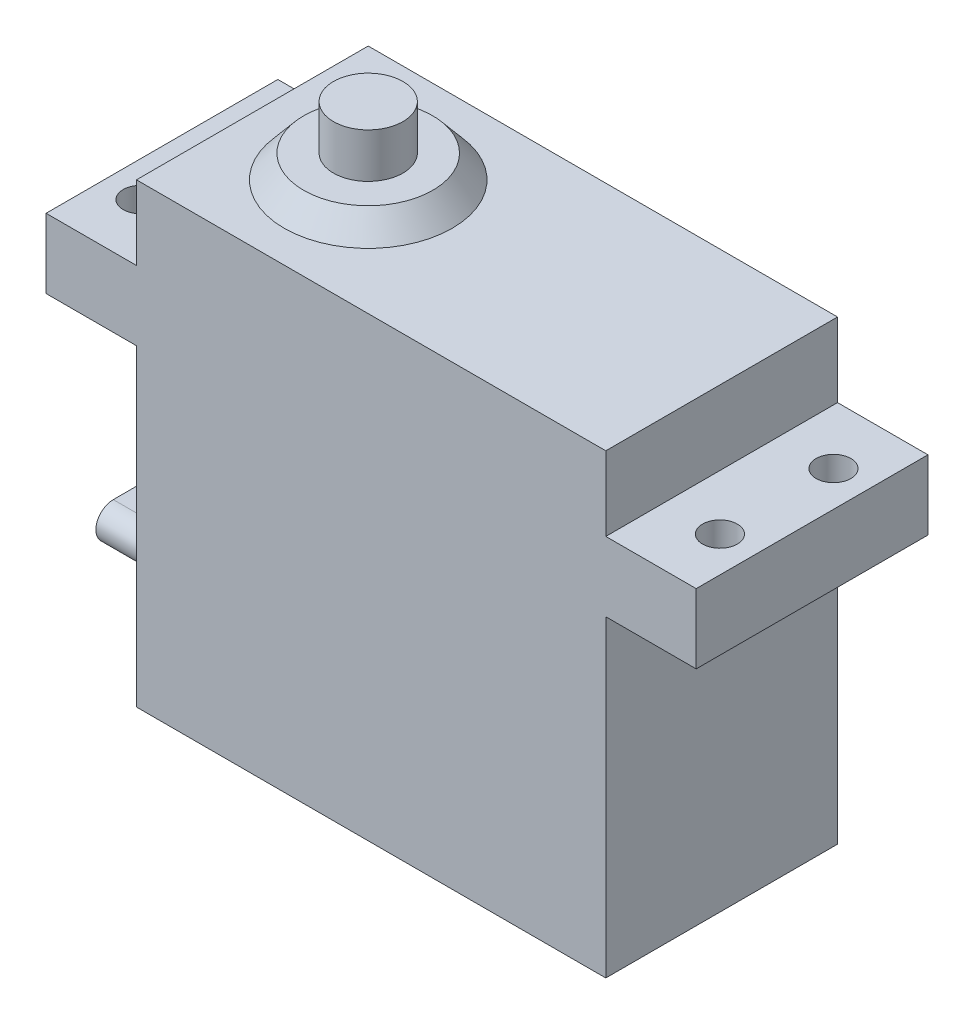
ISO-10303-21;
HEADER;
FILE_DESCRIPTION(('STEP AP214'),'2;1');
FILE_NAME('part.step','',(''),(''),'','','');
FILE_SCHEMA(('AUTOMOTIVE_DESIGN { 1 0 10303 214 1 1 1 1 }'));
ENDSEC;
DATA;
#1=APPLICATION_CONTEXT('core data for automotive mechanical design processes');
#2=APPLICATION_PROTOCOL_DEFINITION('international standard','automotive_design',2000,#1);
#3=PRODUCT_CONTEXT('',#1,'mechanical');
#4=PRODUCT('Part','Part','',(#3));
#5=PRODUCT_RELATED_PRODUCT_CATEGORY('part','',(#4));
#6=PRODUCT_DEFINITION_FORMATION('','',#4);
#7=PRODUCT_DEFINITION_CONTEXT('part definition',#1,'design');
#8=PRODUCT_DEFINITION('design','',#6,#7);
#9=PRODUCT_DEFINITION_SHAPE('','',#8);
#10=(LENGTH_UNIT() NAMED_UNIT(*) SI_UNIT(.MILLI.,.METRE.));
#11=(NAMED_UNIT(*) PLANE_ANGLE_UNIT() SI_UNIT($,.RADIAN.));
#12=(NAMED_UNIT(*) SI_UNIT($,.STERADIAN.) SOLID_ANGLE_UNIT());
#13=UNCERTAINTY_MEASURE_WITH_UNIT(LENGTH_MEASURE(1.E-05),#10,'distance_accuracy_value','');
#14=(GEOMETRIC_REPRESENTATION_CONTEXT(3) GLOBAL_UNCERTAINTY_ASSIGNED_CONTEXT((#13)) GLOBAL_UNIT_ASSIGNED_CONTEXT((#10,
#11,#12)) REPRESENTATION_CONTEXT('',''));
#15=CARTESIAN_POINT('',(0.,0.,0.));
#16=DIRECTION('',(0.,0.,1.));
#17=DIRECTION('',(1.,0.,0.));
#18=AXIS2_PLACEMENT_3D('',#15,#16,#17);
#19=CARTESIAN_POINT('',(10.,45.25,10.));
#20=DIRECTION('',(0.,-1.,0.));
#21=DIRECTION('',(0.,0.,-1.));
#22=AXIS2_PLACEMENT_3D('',#19,#20,#21);
#23=CYLINDRICAL_SURFACE('',#22,3.);
#24=CARTESIAN_POINT('',(10.,45.25,10.));
#25=DIRECTION('',(0.,1.,0.));
#26=DIRECTION('',(0.,0.,1.));
#27=AXIS2_PLACEMENT_3D('',#24,#25,#26);
#28=CIRCLE('',#27,3.);
#29=CARTESIAN_POINT('',(10.,45.25,7.));
#30=VERTEX_POINT('',#29);
#31=EDGE_CURVE('E11',#30,#30,#28,.T.);
#32=CARTESIAN_POINT('',(10.,41.4,10.));
#33=DIRECTION('',(0.,1.,0.));
#34=DIRECTION('',(0.,0.,1.));
#35=AXIS2_PLACEMENT_3D('',#32,#33,#34);
#36=CIRCLE('',#35,3.);
#37=CARTESIAN_POINT('',(10.,41.4,7.));
#38=VERTEX_POINT('',#37);
#39=EDGE_CURVE('E49',#38,#38,#36,.T.);
#40=CARTESIAN_POINT('',(10.,45.25,7.));
#41=CARTESIAN_POINT('',(10.,45.2098958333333,7.));
#42=CARTESIAN_POINT('',(10.,45.1697916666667,7.));
#43=CARTESIAN_POINT('',(10.,45.0895833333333,7.));
#44=CARTESIAN_POINT('',(10.,45.0494791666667,7.));
#45=CARTESIAN_POINT('',(10.,44.9692708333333,7.));
#46=CARTESIAN_POINT('',(10.,44.9291666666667,7.));
#47=CARTESIAN_POINT('',(10.,44.8489583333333,7.));
#48=CARTESIAN_POINT('',(10.,44.8088541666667,7.));
#49=CARTESIAN_POINT('',(10.,44.7286458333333,7.));
#50=CARTESIAN_POINT('',(10.,44.6885416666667,7.));
#51=CARTESIAN_POINT('',(10.,44.6083333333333,7.));
#52=CARTESIAN_POINT('',(10.,44.5682291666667,7.));
#53=CARTESIAN_POINT('',(10.,44.4880208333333,7.));
#54=CARTESIAN_POINT('',(10.,44.4479166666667,7.));
#55=CARTESIAN_POINT('',(10.,44.3677083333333,7.));
#56=CARTESIAN_POINT('',(10.,44.3276041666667,7.));
#57=CARTESIAN_POINT('',(10.,44.2473958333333,7.));
#58=CARTESIAN_POINT('',(10.,44.2072916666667,7.));
#59=CARTESIAN_POINT('',(10.,44.1270833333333,7.));
#60=CARTESIAN_POINT('',(10.,44.0869791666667,7.));
#61=CARTESIAN_POINT('',(10.,44.0067708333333,7.));
#62=CARTESIAN_POINT('',(10.,43.9666666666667,7.));
#63=CARTESIAN_POINT('',(10.,43.8864583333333,7.));
#64=CARTESIAN_POINT('',(10.,43.8463541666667,7.));
#65=CARTESIAN_POINT('',(10.,43.7661458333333,7.));
#66=CARTESIAN_POINT('',(10.,43.7260416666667,7.));
#67=CARTESIAN_POINT('',(10.,43.6458333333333,7.));
#68=CARTESIAN_POINT('',(10.,43.6057291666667,7.));
#69=CARTESIAN_POINT('',(10.,43.5255208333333,7.));
#70=CARTESIAN_POINT('',(10.,43.4854166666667,7.));
#71=CARTESIAN_POINT('',(10.,43.4052083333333,7.));
#72=CARTESIAN_POINT('',(10.,43.3651041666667,7.));
#73=CARTESIAN_POINT('',(10.,43.2848958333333,7.));
#74=CARTESIAN_POINT('',(10.,43.2447916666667,7.));
#75=CARTESIAN_POINT('',(10.,43.1645833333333,7.));
#76=CARTESIAN_POINT('',(10.,43.1244791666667,7.));
#77=CARTESIAN_POINT('',(10.,43.0442708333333,7.));
#78=CARTESIAN_POINT('',(10.,43.0041666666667,7.));
#79=CARTESIAN_POINT('',(10.,42.9239583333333,7.));
#80=CARTESIAN_POINT('',(10.,42.8838541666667,7.));
#81=CARTESIAN_POINT('',(10.,42.8036458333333,7.));
#82=CARTESIAN_POINT('',(10.,42.7635416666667,7.));
#83=CARTESIAN_POINT('',(10.,42.6833333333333,7.));
#84=CARTESIAN_POINT('',(10.,42.6432291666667,7.));
#85=CARTESIAN_POINT('',(10.,42.5630208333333,7.));
#86=CARTESIAN_POINT('',(10.,42.5229166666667,7.));
#87=CARTESIAN_POINT('',(10.,42.4427083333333,7.));
#88=CARTESIAN_POINT('',(10.,42.4026041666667,7.));
#89=CARTESIAN_POINT('',(10.,42.3223958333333,7.));
#90=CARTESIAN_POINT('',(10.,42.2822916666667,7.));
#91=CARTESIAN_POINT('',(10.,42.2020833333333,7.));
#92=CARTESIAN_POINT('',(10.,42.1619791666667,7.));
#93=CARTESIAN_POINT('',(10.,42.0817708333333,7.));
#94=CARTESIAN_POINT('',(10.,42.0416666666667,7.));
#95=CARTESIAN_POINT('',(10.,41.9614583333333,7.));
#96=CARTESIAN_POINT('',(10.,41.9213541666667,7.));
#97=CARTESIAN_POINT('',(10.,41.8411458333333,7.));
#98=CARTESIAN_POINT('',(10.,41.8010416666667,7.));
#99=CARTESIAN_POINT('',(10.,41.7208333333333,7.));
#100=CARTESIAN_POINT('',(10.,41.6807291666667,7.));
#101=CARTESIAN_POINT('',(10.,41.6005208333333,7.));
#102=CARTESIAN_POINT('',(10.,41.5604166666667,7.));
#103=CARTESIAN_POINT('',(10.,41.4802083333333,7.));
#104=CARTESIAN_POINT('',(10.,41.4401041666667,7.));
#105=CARTESIAN_POINT('',(10.,41.4,7.));
#106=B_SPLINE_CURVE_WITH_KNOTS('',3,(#40,#41,#42,#43,#44,#45,#46,#47,#48,#49,#50,#51,#52,#53,
#54,#55,#56,#57,#58,#59,#60,#61,#62,#63,#64,#65,#66,#67,#68,#69,#70,#71,#72,#73,#74,#75,#76,#77,
#78,#79,#80,#81,#82,#83,#84,#85,#86,#87,#88,#89,#90,#91,#92,#93,#94,#95,#96,#97,#98,#99,#100,
#101,#102,#103,#104,#105),.UNSPECIFIED.,.F.,.F.,(4,2,2,2,2,2,2,2,2,2,2,2,2,2,2,2,2,2,2,2,2,2,2,
2,2,2,2,2,2,2,2,2,4),(0.,0.120312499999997,0.240624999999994,0.360937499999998,
0.481249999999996,0.6015625,0.721874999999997,0.842187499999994,0.962499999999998,1.0828125,
1.203125,1.3234375,1.44374999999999,1.5640625,1.68437499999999,1.8046875,1.925,2.04531249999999,
2.165625,2.28593749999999,2.40625,2.5265625,2.64687499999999,2.7671875,2.88749999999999,
3.0078125,3.128125,3.24843749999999,3.36875,3.48906249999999,3.609375,3.7296875,
3.84999999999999),.UNSPECIFIED.);
#107=EDGE_CURVE('BSEAM46',#30,#38,#106,.T.);
#108=ORIENTED_EDGE('',*,*,#31,.F.);
#109=ORIENTED_EDGE('',*,*,#39,.T.);
#110=ORIENTED_EDGE('',*,*,#107,.T.);
#111=ORIENTED_EDGE('',*,*,#107,.F.);
#112=EDGE_LOOP('',(#108,#110,#109,#111));
#113=FACE_BOUND('',#112,.T.);
#114=ADVANCED_FACE('F46',(#113),#23,.T.);
#115=CARTESIAN_POINT('',(10.,45.25,10.));
#116=DIRECTION('',(0.,1.,0.));
#117=DIRECTION('',(0.,0.,1.));
#118=AXIS2_PLACEMENT_3D('',#115,#116,#117);
#119=PLANE('',#118);
#120=ORIENTED_EDGE('',*,*,#31,.T.);
#121=EDGE_LOOP('',(#120));
#122=FACE_BOUND('',#121,.T.);
#123=ADVANCED_FACE('F61',(#122),#119,.T.);
#124=CARTESIAN_POINT('',(10.,41.4,10.));
#125=DIRECTION('',(0.,1.,0.));
#126=DIRECTION('',(0.,0.,1.));
#127=AXIS2_PLACEMENT_3D('',#124,#125,#126);
#128=PLANE('',#127);
#129=ORIENTED_EDGE('',*,*,#39,.F.);
#130=EDGE_LOOP('',(#129));
#131=FACE_BOUND('',#130,.T.);
#132=ADVANCED_FACE('F59',(#131),#128,.F.);
#133=CLOSED_SHELL('',(#114,#123,#132));
#134=MANIFOLD_SOLID_BREP('B2',#133);
#135=CARTESIAN_POINT('',(0.,39.4,20.));
#136=DIRECTION('',(0.,-1.,0.));
#137=DIRECTION('',(0.,0.,-1.));
#138=AXIS2_PLACEMENT_3D('',#135,#136,#137);
#139=PLANE('',#138);
#140=DIRECTION('',(-1.,0.,0.));
#141=VECTOR('',#140,1.);
#142=CARTESIAN_POINT('',(0.,39.4,0.));
#143=LINE('',#142,#141);
#144=CARTESIAN_POINT('',(40.5,39.4,0.));
#145=VERTEX_POINT('',#144);
#146=CARTESIAN_POINT('',(0.,39.4,0.));
#147=VERTEX_POINT('',#146);
#148=EDGE_CURVE('E344',#145,#147,#143,.T.);
#149=ORIENTED_EDGE('',*,*,#148,.T.);
#150=DIRECTION('',(0.,0.,-1.));
#151=VECTOR('',#150,1.);
#152=CARTESIAN_POINT('',(0.,39.4,20.));
#153=LINE('',#152,#151);
#154=CARTESIAN_POINT('',(0.,39.4,20.));
#155=VERTEX_POINT('',#154);
#156=EDGE_CURVE('E364',#155,#147,#153,.T.);
#157=ORIENTED_EDGE('',*,*,#156,.F.);
#158=DIRECTION('',(-1.,0.,0.));
#159=VECTOR('',#158,1.);
#160=CARTESIAN_POINT('',(0.,39.4,20.));
#161=LINE('',#160,#159);
#162=CARTESIAN_POINT('',(40.5,39.4,20.));
#163=VERTEX_POINT('',#162);
#164=EDGE_CURVE('E318',#163,#155,#161,.T.);
#165=ORIENTED_EDGE('',*,*,#164,.F.);
#166=DIRECTION('',(0.,0.,-1.));
#167=VECTOR('',#166,1.);
#168=CARTESIAN_POINT('',(40.5,39.4,20.));
#169=LINE('',#168,#167);
#170=EDGE_CURVE('E367',#163,#145,#169,.T.);
#171=ORIENTED_EDGE('',*,*,#170,.T.);
#172=EDGE_LOOP('',(#149,#157,#165,#171));
#173=FACE_BOUND('',#172,.T.);
#174=CARTESIAN_POINT('',(10.,39.4,10.));
#175=DIRECTION('',(0.,-1.,0.));
#176=DIRECTION('',(0.,0.,-1.));
#177=AXIS2_PLACEMENT_3D('',#174,#175,#176);
#178=CIRCLE('',#177,7.25);
#179=CARTESIAN_POINT('',(10.,39.4,2.75));
#180=VERTEX_POINT('',#179);
#181=EDGE_CURVE('E44',#180,#180,#178,.F.);
#182=ORIENTED_EDGE('',*,*,#181,.F.);
#183=EDGE_LOOP('',(#182));
#184=FACE_BOUND('',#183,.T.);
#185=ADVANCED_FACE('F86',(#173,#184),#139,.F.);
#186=CARTESIAN_POINT('',(-0.5,4.5,8.50000000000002));
#187=DIRECTION('',(-1.,0.,0.));
#188=DIRECTION('',(0.,0.,1.));
#189=AXIS2_PLACEMENT_3D('',#186,#187,#188);
#190=PLANE('',#189);
#191=CARTESIAN_POINT('',(-0.5,4.5,8.50000000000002));
#192=DIRECTION('',(-1.,0.,0.));
#193=DIRECTION('',(0.,0.,1.));
#194=AXIS2_PLACEMENT_3D('',#191,#192,#193);
#195=CIRCLE('',#194,2.);
#196=CARTESIAN_POINT('',(-0.5,6.5,8.50000000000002));
#197=VERTEX_POINT('',#196);
#198=CARTESIAN_POINT('',(-0.5,2.5,8.50000000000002));
#199=VERTEX_POINT('',#198);
#200=EDGE_CURVE('E255',#197,#199,#195,.T.);
#201=ORIENTED_EDGE('',*,*,#200,.T.);
#202=DIRECTION('',(0.,0.,1.));
#203=VECTOR('',#202,1.);
#204=CARTESIAN_POINT('',(-0.5,2.5,11.5));
#205=LINE('',#204,#203);
#206=CARTESIAN_POINT('',(-0.5,2.5,11.5));
#207=VERTEX_POINT('',#206);
#208=EDGE_CURVE('E258',#199,#207,#205,.T.);
#209=ORIENTED_EDGE('',*,*,#208,.T.);
#210=CARTESIAN_POINT('',(-0.5,4.5,11.5));
#211=DIRECTION('',(-1.,0.,0.));
#212=DIRECTION('',(0.,0.,-1.));
#213=AXIS2_PLACEMENT_3D('',#210,#211,#212);
#214=CIRCLE('',#213,2.);
#215=CARTESIAN_POINT('',(-0.5,6.5,11.5));
#216=VERTEX_POINT('',#215);
#217=EDGE_CURVE('E261',#207,#216,#214,.T.);
#218=ORIENTED_EDGE('',*,*,#217,.T.);
#219=DIRECTION('',(0.,0.,-1.));
#220=VECTOR('',#219,1.);
#221=CARTESIAN_POINT('',(-0.5,6.5,8.50000000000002));
#222=LINE('',#221,#220);
#223=EDGE_CURVE('E263',#216,#197,#222,.T.);
#224=ORIENTED_EDGE('',*,*,#223,.T.);
#225=EDGE_LOOP('',(#201,#209,#218,#224));
#226=FACE_BOUND('',#225,.T.);
#227=DIRECTION('',(0.,0.,1.));
#228=VECTOR('',#227,1.);
#229=CARTESIAN_POINT('',(-0.5,3.,8.50000000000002));
#230=LINE('',#229,#228);
#231=CARTESIAN_POINT('',(-0.5,3.,8.50000000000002));
#232=VERTEX_POINT('',#231);
#233=CARTESIAN_POINT('',(-0.5,3.,11.5));
#234=VERTEX_POINT('',#233);
#235=EDGE_CURVE('E674',#232,#234,#230,.T.);
#236=ORIENTED_EDGE('',*,*,#235,.F.);
#237=CARTESIAN_POINT('',(-0.5,4.5,8.50000000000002));
#238=DIRECTION('',(-1.,0.,0.));
#239=DIRECTION('',(0.,0.,1.));
#240=AXIS2_PLACEMENT_3D('',#237,#238,#239);
#241=CIRCLE('',#240,1.5);
#242=CARTESIAN_POINT('',(-0.5,6.,8.50000000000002));
#243=VERTEX_POINT('',#242);
#244=EDGE_CURVE('E246',#243,#232,#241,.T.);
#245=ORIENTED_EDGE('',*,*,#244,.F.);
#246=DIRECTION('',(0.,0.,-1.));
#247=VECTOR('',#246,1.);
#248=CARTESIAN_POINT('',(-0.5,6.,11.5));
#249=LINE('',#248,#247);
#250=CARTESIAN_POINT('',(-0.5,6.,11.5));
#251=VERTEX_POINT('',#250);
#252=EDGE_CURVE('E242',#251,#243,#249,.T.);
#253=ORIENTED_EDGE('',*,*,#252,.F.);
#254=CARTESIAN_POINT('',(-0.5,4.5,11.5));
#255=DIRECTION('',(-1.,0.,0.));
#256=DIRECTION('',(0.,0.,1.));
#257=AXIS2_PLACEMENT_3D('',#254,#255,#256);
#258=CIRCLE('',#257,1.5);
#259=EDGE_CURVE('E681',#234,#251,#258,.T.);
#260=ORIENTED_EDGE('',*,*,#259,.F.);
#261=EDGE_LOOP('',(#236,#245,#253,#260));
#262=FACE_BOUND('',#261,.T.);
#263=ADVANCED_FACE('F411',(#226,#262),#190,.T.);
#264=CARTESIAN_POINT('',(0.,0.,20.));
#265=DIRECTION('',(1.,0.,0.));
#266=DIRECTION('',(0.,0.,-1.));
#267=AXIS2_PLACEMENT_3D('',#264,#265,#266);
#268=PLANE('',#267);
#269=DIRECTION('',(0.,-1.,0.));
#270=VECTOR('',#269,1.);
#271=CARTESIAN_POINT('',(0.,0.,0.));
#272=LINE('',#271,#270);
#273=CARTESIAN_POINT('',(0.,27.,0.));
#274=VERTEX_POINT('',#273);
#275=CARTESIAN_POINT('',(0.,0.,0.));
#276=VERTEX_POINT('',#275);
#277=EDGE_CURVE('E329',#274,#276,#272,.T.);
#278=ORIENTED_EDGE('',*,*,#277,.T.);
#279=DIRECTION('',(0.,0.,-1.));
#280=VECTOR('',#279,1.);
#281=CARTESIAN_POINT('',(0.,0.,20.));
#282=LINE('',#281,#280);
#283=CARTESIAN_POINT('',(0.,0.,20.));
#284=VERTEX_POINT('',#283);
#285=EDGE_CURVE('E94',#284,#276,#282,.T.);
#286=ORIENTED_EDGE('',*,*,#285,.F.);
#287=DIRECTION('',(0.,-1.,0.));
#288=VECTOR('',#287,1.);
#289=CARTESIAN_POINT('',(0.,0.,20.));
#290=LINE('',#289,#288);
#291=CARTESIAN_POINT('',(0.,27.,20.));
#292=VERTEX_POINT('',#291);
#293=EDGE_CURVE('E302',#292,#284,#290,.T.);
#294=ORIENTED_EDGE('',*,*,#293,.F.);
#295=DIRECTION('',(0.,0.,-1.));
#296=VECTOR('',#295,1.);
#297=CARTESIAN_POINT('',(0.,27.,20.));
#298=LINE('',#297,#296);
#299=EDGE_CURVE('E328',#292,#274,#298,.T.);
#300=ORIENTED_EDGE('',*,*,#299,.T.);
#301=EDGE_LOOP('',(#278,#286,#294,#300));
#302=FACE_BOUND('',#301,.T.);
#303=CARTESIAN_POINT('',(0.,4.5,8.50000000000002));
#304=DIRECTION('',(-1.,0.,0.));
#305=DIRECTION('',(0.,0.,1.));
#306=AXIS2_PLACEMENT_3D('',#303,#304,#305);
#307=CIRCLE('',#306,2.);
#308=CARTESIAN_POINT('',(0.,6.5,8.50000000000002));
#309=VERTEX_POINT('',#308);
#310=CARTESIAN_POINT('',(0.,2.5,8.50000000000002));
#311=VERTEX_POINT('',#310);
#312=EDGE_CURVE('E248',#309,#311,#307,.T.);
#313=ORIENTED_EDGE('',*,*,#312,.F.);
#314=DIRECTION('',(0.,0.,-1.));
#315=VECTOR('',#314,1.);
#316=CARTESIAN_POINT('',(0.,6.5,8.50000000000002));
#317=LINE('',#316,#315);
#318=CARTESIAN_POINT('',(0.,6.5,11.5));
#319=VERTEX_POINT('',#318);
#320=EDGE_CURVE('E259',#319,#309,#317,.T.);
#321=ORIENTED_EDGE('',*,*,#320,.F.);
#322=CARTESIAN_POINT('',(0.,4.5,11.5));
#323=DIRECTION('',(-1.,0.,0.));
#324=DIRECTION('',(0.,0.,-1.));
#325=AXIS2_PLACEMENT_3D('',#322,#323,#324);
#326=CIRCLE('',#325,2.);
#327=CARTESIAN_POINT('',(0.,2.5,11.5));
#328=VERTEX_POINT('',#327);
#329=EDGE_CURVE('E267',#328,#319,#326,.T.);
#330=ORIENTED_EDGE('',*,*,#329,.F.);
#331=DIRECTION('',(0.,0.,1.));
#332=VECTOR('',#331,1.);
#333=CARTESIAN_POINT('',(0.,2.5,11.5));
#334=LINE('',#333,#332);
#335=EDGE_CURVE('E109',#311,#328,#334,.T.);
#336=ORIENTED_EDGE('',*,*,#335,.F.);
#337=EDGE_LOOP('',(#313,#321,#330,#336));
#338=FACE_BOUND('',#337,.T.);
#339=ADVANCED_FACE('F88',(#302,#338),#268,.F.);
#340=CARTESIAN_POINT('',(0.,0.,20.));
#341=DIRECTION('',(0.,1.,0.));
#342=DIRECTION('',(0.,0.,1.));
#343=AXIS2_PLACEMENT_3D('',#340,#341,#342);
#344=PLANE('',#343);
#345=DIRECTION('',(1.,0.,0.));
#346=VECTOR('',#345,1.);
#347=CARTESIAN_POINT('',(0.,0.,0.));
#348=LINE('',#347,#346);
#349=CARTESIAN_POINT('',(40.5,0.,0.));
#350=VERTEX_POINT('',#349);
#351=EDGE_CURVE('E332',#276,#350,#348,.T.);
#352=ORIENTED_EDGE('',*,*,#351,.T.);
#353=DIRECTION('',(0.,0.,-1.));
#354=VECTOR('',#353,1.);
#355=CARTESIAN_POINT('',(40.5,0.,20.));
#356=LINE('',#355,#354);
#357=CARTESIAN_POINT('',(40.5,0.,20.));
#358=VERTEX_POINT('',#357);
#359=EDGE_CURVE('E382',#358,#350,#356,.T.);
#360=ORIENTED_EDGE('',*,*,#359,.F.);
#361=DIRECTION('',(1.,0.,0.));
#362=VECTOR('',#361,1.);
#363=CARTESIAN_POINT('',(0.,0.,20.));
#364=LINE('',#363,#362);
#365=EDGE_CURVE('E305',#284,#358,#364,.T.);
#366=ORIENTED_EDGE('',*,*,#365,.F.);
#367=ORIENTED_EDGE('',*,*,#285,.T.);
#368=EDGE_LOOP('',(#352,#360,#366,#367));
#369=FACE_BOUND('',#368,.T.);
#370=ADVANCED_FACE('F442',(#369),#344,.F.);
#371=CARTESIAN_POINT('',(40.5,0.,20.));
#372=DIRECTION('',(-1.,0.,0.));
#373=DIRECTION('',(0.,0.,1.));
#374=AXIS2_PLACEMENT_3D('',#371,#372,#373);
#375=PLANE('',#374);
#376=DIRECTION('',(0.,1.,0.));
#377=VECTOR('',#376,1.);
#378=CARTESIAN_POINT('',(40.5,0.,0.));
#379=LINE('',#378,#377);
#380=CARTESIAN_POINT('',(40.5,27.,0.));
#381=VERTEX_POINT('',#380);
#382=EDGE_CURVE('E334',#350,#381,#379,.T.);
#383=ORIENTED_EDGE('',*,*,#382,.T.);
#384=DIRECTION('',(0.,0.,-1.));
#385=VECTOR('',#384,1.);
#386=CARTESIAN_POINT('',(40.5,27.,20.));
#387=LINE('',#386,#385);
#388=CARTESIAN_POINT('',(40.5,27.,20.));
#389=VERTEX_POINT('',#388);
#390=EDGE_CURVE('E379',#389,#381,#387,.T.);
#391=ORIENTED_EDGE('',*,*,#390,.F.);
#392=DIRECTION('',(0.,1.,0.));
#393=VECTOR('',#392,1.);
#394=CARTESIAN_POINT('',(40.5,0.,20.));
#395=LINE('',#394,#393);
#396=EDGE_CURVE('E308',#358,#389,#395,.T.);
#397=ORIENTED_EDGE('',*,*,#396,.F.);
#398=ORIENTED_EDGE('',*,*,#359,.T.);
#399=EDGE_LOOP('',(#383,#391,#397,#398));
#400=FACE_BOUND('',#399,.T.);
#401=ADVANCED_FACE('F439',(#400),#375,.F.);
#402=CARTESIAN_POINT('',(40.5,27.,20.));
#403=DIRECTION('',(0.,1.,0.));
#404=DIRECTION('',(-1.,0.,0.));
#405=AXIS2_PLACEMENT_3D('',#402,#403,#404);
#406=PLANE('',#405);
#407=CARTESIAN_POINT('',(45.25,27.,5.1));
#408=DIRECTION('',(0.,1.,0.));
#409=DIRECTION('',(-1.,0.,0.));
#410=AXIS2_PLACEMENT_3D('',#407,#408,#409);
#411=CIRCLE('',#410,1.5);
#412=CARTESIAN_POINT('',(43.75,27.,5.1));
#413=VERTEX_POINT('',#412);
#414=EDGE_CURVE('E285',#413,#413,#411,.T.);
#415=ORIENTED_EDGE('',*,*,#414,.T.);
#416=EDGE_LOOP('',(#415));
#417=FACE_BOUND('',#416,.T.);
#418=CARTESIAN_POINT('',(45.25,27.,14.9));
#419=DIRECTION('',(0.,1.,0.));
#420=DIRECTION('',(-1.,0.,0.));
#421=AXIS2_PLACEMENT_3D('',#418,#419,#420);
#422=CIRCLE('',#421,1.5);
#423=CARTESIAN_POINT('',(43.75,27.,14.9));
#424=VERTEX_POINT('',#423);
#425=EDGE_CURVE('E291',#424,#424,#422,.T.);
#426=ORIENTED_EDGE('',*,*,#425,.T.);
#427=EDGE_LOOP('',(#426));
#428=FACE_BOUND('',#427,.T.);
#429=DIRECTION('',(1.,0.,0.));
#430=VECTOR('',#429,1.);
#431=CARTESIAN_POINT('',(40.5,27.,0.));
#432=LINE('',#431,#430);
#433=CARTESIAN_POINT('',(48.3,27.,0.));
#434=VERTEX_POINT('',#433);
#435=EDGE_CURVE('E336',#381,#434,#432,.T.);
#436=ORIENTED_EDGE('',*,*,#435,.T.);
#437=DIRECTION('',(0.,0.,-1.));
#438=VECTOR('',#437,1.);
#439=CARTESIAN_POINT('',(48.3,27.,20.));
#440=LINE('',#439,#438);
#441=CARTESIAN_POINT('',(48.3,27.,20.));
#442=VERTEX_POINT('',#441);
#443=EDGE_CURVE('E376',#442,#434,#440,.T.);
#444=ORIENTED_EDGE('',*,*,#443,.F.);
#445=DIRECTION('',(1.,0.,0.));
#446=VECTOR('',#445,1.);
#447=CARTESIAN_POINT('',(40.5,27.,20.));
#448=LINE('',#447,#446);
#449=EDGE_CURVE('E310',#389,#442,#448,.T.);
#450=ORIENTED_EDGE('',*,*,#449,.F.);
#451=ORIENTED_EDGE('',*,*,#390,.T.);
#452=EDGE_LOOP('',(#436,#444,#450,#451));
#453=FACE_BOUND('',#452,.T.);
#454=ADVANCED_FACE('F435',(#417,#428,#453),#406,.F.);
#455=CARTESIAN_POINT('',(48.3,27.,20.));
#456=DIRECTION('',(-1.,0.,0.));
#457=DIRECTION('',(0.,0.,1.));
#458=AXIS2_PLACEMENT_3D('',#455,#456,#457);
#459=PLANE('',#458);
#460=DIRECTION('',(0.,1.,0.));
#461=VECTOR('',#460,1.);
#462=CARTESIAN_POINT('',(48.3,27.,0.));
#463=LINE('',#462,#461);
#464=CARTESIAN_POINT('',(48.3,33.,0.));
#465=VERTEX_POINT('',#464);
#466=EDGE_CURVE('E338',#434,#465,#463,.T.);
#467=ORIENTED_EDGE('',*,*,#466,.T.);
#468=DIRECTION('',(0.,0.,-1.));
#469=VECTOR('',#468,1.);
#470=CARTESIAN_POINT('',(48.3,33.,20.));
#471=LINE('',#470,#469);
#472=CARTESIAN_POINT('',(48.3,33.,20.));
#473=VERTEX_POINT('',#472);
#474=EDGE_CURVE('E373',#473,#465,#471,.T.);
#475=ORIENTED_EDGE('',*,*,#474,.F.);
#476=DIRECTION('',(0.,1.,0.));
#477=VECTOR('',#476,1.);
#478=CARTESIAN_POINT('',(48.3,27.,20.));
#479=LINE('',#478,#477);
#480=EDGE_CURVE('E312',#442,#473,#479,.T.);
#481=ORIENTED_EDGE('',*,*,#480,.F.);
#482=ORIENTED_EDGE('',*,*,#443,.T.);
#483=EDGE_LOOP('',(#467,#475,#481,#482));
#484=FACE_BOUND('',#483,.T.);
#485=ADVANCED_FACE('F431',(#484),#459,.F.);
#486=CARTESIAN_POINT('',(48.3,33.,20.));
#487=DIRECTION('',(0.,-1.,0.));
#488=DIRECTION('',(0.,0.,-1.));
#489=AXIS2_PLACEMENT_3D('',#486,#487,#488);
#490=PLANE('',#489);
#491=CARTESIAN_POINT('',(45.25,33.,5.1));
#492=DIRECTION('',(0.,1.,0.));
#493=DIRECTION('',(0.,0.,1.));
#494=AXIS2_PLACEMENT_3D('',#491,#492,#493);
#495=CIRCLE('',#494,1.5);
#496=CARTESIAN_POINT('',(45.25,33.,6.6));
#497=VERTEX_POINT('',#496);
#498=EDGE_CURVE('E282',#497,#497,#495,.T.);
#499=ORIENTED_EDGE('',*,*,#498,.F.);
#500=EDGE_LOOP('',(#499));
#501=FACE_BOUND('',#500,.T.);
#502=CARTESIAN_POINT('',(45.25,33.,14.9));
#503=DIRECTION('',(0.,1.,0.));
#504=DIRECTION('',(0.,0.,1.));
#505=AXIS2_PLACEMENT_3D('',#502,#503,#504);
#506=CIRCLE('',#505,1.5);
#507=CARTESIAN_POINT('',(45.25,33.,16.4));
#508=VERTEX_POINT('',#507);
#509=EDGE_CURVE('E288',#508,#508,#506,.T.);
#510=ORIENTED_EDGE('',*,*,#509,.F.);
#511=EDGE_LOOP('',(#510));
#512=FACE_BOUND('',#511,.T.);
#513=DIRECTION('',(-1.,0.,0.));
#514=VECTOR('',#513,1.);
#515=CARTESIAN_POINT('',(48.3,33.,0.));
#516=LINE('',#515,#514);
#517=CARTESIAN_POINT('',(40.5,33.,0.));
#518=VERTEX_POINT('',#517);
#519=EDGE_CURVE('E340',#465,#518,#516,.T.);
#520=ORIENTED_EDGE('',*,*,#519,.T.);
#521=DIRECTION('',(0.,0.,-1.));
#522=VECTOR('',#521,1.);
#523=CARTESIAN_POINT('',(40.5,33.,20.));
#524=LINE('',#523,#522);
#525=CARTESIAN_POINT('',(40.5,33.,20.));
#526=VERTEX_POINT('',#525);
#527=EDGE_CURVE('E370',#526,#518,#524,.T.);
#528=ORIENTED_EDGE('',*,*,#527,.F.);
#529=DIRECTION('',(-1.,0.,0.));
#530=VECTOR('',#529,1.);
#531=CARTESIAN_POINT('',(48.3,33.,20.));
#532=LINE('',#531,#530);
#533=EDGE_CURVE('E314',#473,#526,#532,.T.);
#534=ORIENTED_EDGE('',*,*,#533,.F.);
#535=ORIENTED_EDGE('',*,*,#474,.T.);
#536=EDGE_LOOP('',(#520,#528,#534,#535));
#537=FACE_BOUND('',#536,.T.);
#538=ADVANCED_FACE('F427',(#501,#512,#537),#490,.F.);
#539=CARTESIAN_POINT('',(40.5,33.,20.));
#540=DIRECTION('',(-1.,0.,0.));
#541=DIRECTION('',(0.,0.,1.));
#542=AXIS2_PLACEMENT_3D('',#539,#540,#541);
#543=PLANE('',#542);
#544=DIRECTION('',(0.,1.,0.));
#545=VECTOR('',#544,1.);
#546=CARTESIAN_POINT('',(40.5,33.,0.));
#547=LINE('',#546,#545);
#548=EDGE_CURVE('E342',#518,#145,#547,.T.);
#549=ORIENTED_EDGE('',*,*,#548,.T.);
#550=ORIENTED_EDGE('',*,*,#170,.F.);
#551=DIRECTION('',(0.,1.,0.));
#552=VECTOR('',#551,1.);
#553=CARTESIAN_POINT('',(40.5,33.,20.));
#554=LINE('',#553,#552);
#555=EDGE_CURVE('E316',#526,#163,#554,.T.);
#556=ORIENTED_EDGE('',*,*,#555,.F.);
#557=ORIENTED_EDGE('',*,*,#527,.T.);
#558=EDGE_LOOP('',(#549,#550,#556,#557));
#559=FACE_BOUND('',#558,.T.);
#560=ADVANCED_FACE('F424',(#559),#543,.F.);
#561=CARTESIAN_POINT('',(0.,33.,20.));
#562=DIRECTION('',(1.,0.,0.));
#563=DIRECTION('',(0.,1.,0.));
#564=AXIS2_PLACEMENT_3D('',#561,#562,#563);
#565=PLANE('',#564);
#566=DIRECTION('',(0.,-1.,0.));
#567=VECTOR('',#566,1.);
#568=CARTESIAN_POINT('',(0.,33.,0.));
#569=LINE('',#568,#567);
#570=CARTESIAN_POINT('',(0.,33.,0.));
#571=VERTEX_POINT('',#570);
#572=EDGE_CURVE('E346',#147,#571,#569,.T.);
#573=ORIENTED_EDGE('',*,*,#572,.T.);
#574=DIRECTION('',(0.,0.,-1.));
#575=VECTOR('',#574,1.);
#576=CARTESIAN_POINT('',(0.,33.,20.));
#577=LINE('',#576,#575);
#578=CARTESIAN_POINT('',(0.,33.,20.));
#579=VERTEX_POINT('',#578);
#580=EDGE_CURVE('E361',#579,#571,#577,.T.);
#581=ORIENTED_EDGE('',*,*,#580,.F.);
#582=DIRECTION('',(0.,-1.,0.));
#583=VECTOR('',#582,1.);
#584=CARTESIAN_POINT('',(0.,33.,20.));
#585=LINE('',#584,#583);
#586=EDGE_CURVE('E320',#155,#579,#585,.T.);
#587=ORIENTED_EDGE('',*,*,#586,.F.);
#588=ORIENTED_EDGE('',*,*,#156,.T.);
#589=EDGE_LOOP('',(#573,#581,#587,#588));
#590=FACE_BOUND('',#589,.T.);
#591=ADVANCED_FACE('F422',(#590),#565,.F.);
#592=CARTESIAN_POINT('',(0.,33.,20.));
#593=DIRECTION('',(0.,-1.,0.));
#594=DIRECTION('',(0.,0.,-1.));
#595=AXIS2_PLACEMENT_3D('',#592,#593,#594);
#596=PLANE('',#595);
#597=CARTESIAN_POINT('',(-4.75,33.,14.9));
#598=DIRECTION('',(0.,1.,0.));
#599=DIRECTION('',(0.,0.,1.));
#600=AXIS2_PLACEMENT_3D('',#597,#598,#599);
#601=CIRCLE('',#600,1.5);
#602=CARTESIAN_POINT('',(-4.75,33.,16.4));
#603=VERTEX_POINT('',#602);
#604=EDGE_CURVE('E294',#603,#603,#601,.T.);
#605=ORIENTED_EDGE('',*,*,#604,.F.);
#606=EDGE_LOOP('',(#605));
#607=FACE_BOUND('',#606,.T.);
#608=CARTESIAN_POINT('',(-4.75,33.,5.1));
#609=DIRECTION('',(0.,1.,0.));
#610=DIRECTION('',(0.,0.,1.));
#611=AXIS2_PLACEMENT_3D('',#608,#609,#610);
#612=CIRCLE('',#611,1.5);
#613=CARTESIAN_POINT('',(-4.75,33.,6.6));
#614=VERTEX_POINT('',#613);
#615=EDGE_CURVE('E298',#614,#614,#612,.T.);
#616=ORIENTED_EDGE('',*,*,#615,.F.);
#617=EDGE_LOOP('',(#616));
#618=FACE_BOUND('',#617,.T.);
#619=DIRECTION('',(-1.,0.,0.));
#620=VECTOR('',#619,1.);
#621=CARTESIAN_POINT('',(0.,33.,0.));
#622=LINE('',#621,#620);
#623=CARTESIAN_POINT('',(-7.8,33.,0.));
#624=VERTEX_POINT('',#623);
#625=EDGE_CURVE('E348',#571,#624,#622,.T.);
#626=ORIENTED_EDGE('',*,*,#625,.T.);
#627=DIRECTION('',(0.,0.,-1.));
#628=VECTOR('',#627,1.);
#629=CARTESIAN_POINT('',(-7.8,33.,20.));
#630=LINE('',#629,#628);
#631=CARTESIAN_POINT('',(-7.8,33.,20.));
#632=VERTEX_POINT('',#631);
#633=EDGE_CURVE('E358',#632,#624,#630,.T.);
#634=ORIENTED_EDGE('',*,*,#633,.F.);
#635=DIRECTION('',(-1.,0.,0.));
#636=VECTOR('',#635,1.);
#637=CARTESIAN_POINT('',(0.,33.,20.));
#638=LINE('',#637,#636);
#639=EDGE_CURVE('E322',#579,#632,#638,.T.);
#640=ORIENTED_EDGE('',*,*,#639,.F.);
#641=ORIENTED_EDGE('',*,*,#580,.T.);
#642=EDGE_LOOP('',(#626,#634,#640,#641));
#643=FACE_BOUND('',#642,.T.);
#644=ADVANCED_FACE('F483',(#607,#618,#643),#596,.F.);
#645=CARTESIAN_POINT('',(-7.8,27.,20.));
#646=DIRECTION('',(1.,0.,0.));
#647=DIRECTION('',(0.,1.,0.));
#648=AXIS2_PLACEMENT_3D('',#645,#646,#647);
#649=PLANE('',#648);
#650=DIRECTION('',(0.,-1.,0.));
#651=VECTOR('',#650,1.);
#652=CARTESIAN_POINT('',(-7.8,27.,0.));
#653=LINE('',#652,#651);
#654=CARTESIAN_POINT('',(-7.8,27.,0.));
#655=VERTEX_POINT('',#654);
#656=EDGE_CURVE('E350',#624,#655,#653,.T.);
#657=ORIENTED_EDGE('',*,*,#656,.T.);
#658=DIRECTION('',(0.,0.,-1.));
#659=VECTOR('',#658,1.);
#660=CARTESIAN_POINT('',(-7.8,27.,20.));
#661=LINE('',#660,#659);
#662=CARTESIAN_POINT('',(-7.8,27.,20.));
#663=VERTEX_POINT('',#662);
#664=EDGE_CURVE('E355',#663,#655,#661,.T.);
#665=ORIENTED_EDGE('',*,*,#664,.F.);
#666=DIRECTION('',(0.,-1.,0.));
#667=VECTOR('',#666,1.);
#668=CARTESIAN_POINT('',(-7.8,27.,20.));
#669=LINE('',#668,#667);
#670=EDGE_CURVE('E324',#632,#663,#669,.T.);
#671=ORIENTED_EDGE('',*,*,#670,.F.);
#672=ORIENTED_EDGE('',*,*,#633,.T.);
#673=EDGE_LOOP('',(#657,#665,#671,#672));
#674=FACE_BOUND('',#673,.T.);
#675=ADVANCED_FACE('F479',(#674),#649,.F.);
#676=CARTESIAN_POINT('',(-7.8,27.,20.));
#677=DIRECTION('',(0.,1.,0.));
#678=DIRECTION('',(0.,0.,1.));
#679=AXIS2_PLACEMENT_3D('',#676,#677,#678);
#680=PLANE('',#679);
#681=CARTESIAN_POINT('',(-4.75,27.,14.9));
#682=DIRECTION('',(0.,1.,0.));
#683=DIRECTION('',(0.,0.,1.));
#684=AXIS2_PLACEMENT_3D('',#681,#682,#683);
#685=CIRCLE('',#684,1.5);
#686=CARTESIAN_POINT('',(-4.75,27.,16.4));
#687=VERTEX_POINT('',#686);
#688=EDGE_CURVE('E297',#687,#687,#685,.T.);
#689=ORIENTED_EDGE('',*,*,#688,.T.);
#690=EDGE_LOOP('',(#689));
#691=FACE_BOUND('',#690,.T.);
#692=CARTESIAN_POINT('',(-4.75,27.,5.1));
#693=DIRECTION('',(0.,1.,0.));
#694=DIRECTION('',(0.,0.,1.));
#695=AXIS2_PLACEMENT_3D('',#692,#693,#694);
#696=CIRCLE('',#695,1.5);
#697=CARTESIAN_POINT('',(-4.75,27.,6.6));
#698=VERTEX_POINT('',#697);
#699=EDGE_CURVE('E301',#698,#698,#696,.T.);
#700=ORIENTED_EDGE('',*,*,#699,.T.);
#701=EDGE_LOOP('',(#700));
#702=FACE_BOUND('',#701,.T.);
#703=DIRECTION('',(1.,0.,0.));
#704=VECTOR('',#703,1.);
#705=CARTESIAN_POINT('',(-7.8,27.,0.));
#706=LINE('',#705,#704);
#707=EDGE_CURVE('E306',#655,#274,#706,.T.);
#708=ORIENTED_EDGE('',*,*,#707,.T.);
#709=ORIENTED_EDGE('',*,*,#299,.F.);
#710=DIRECTION('',(1.,0.,0.));
#711=VECTOR('',#710,1.);
#712=CARTESIAN_POINT('',(-7.8,27.,20.));
#713=LINE('',#712,#711);
#714=EDGE_CURVE('E326',#663,#292,#713,.T.);
#715=ORIENTED_EDGE('',*,*,#714,.F.);
#716=ORIENTED_EDGE('',*,*,#664,.T.);
#717=EDGE_LOOP('',(#708,#709,#715,#716));
#718=FACE_BOUND('',#717,.T.);
#719=ADVANCED_FACE('F391',(#691,#702,#718),#680,.F.);
#720=CARTESIAN_POINT('',(0.,27.,20.));
#721=DIRECTION('',(0.,0.,-1.));
#722=DIRECTION('',(-1.,0.,0.));
#723=AXIS2_PLACEMENT_3D('',#720,#721,#722);
#724=PLANE('',#723);
#725=ORIENTED_EDGE('',*,*,#293,.T.);
#726=ORIENTED_EDGE('',*,*,#365,.T.);
#727=ORIENTED_EDGE('',*,*,#396,.T.);
#728=ORIENTED_EDGE('',*,*,#449,.T.);
#729=ORIENTED_EDGE('',*,*,#480,.T.);
#730=ORIENTED_EDGE('',*,*,#533,.T.);
#731=ORIENTED_EDGE('',*,*,#555,.T.);
#732=ORIENTED_EDGE('',*,*,#164,.T.);
#733=ORIENTED_EDGE('',*,*,#586,.T.);
#734=ORIENTED_EDGE('',*,*,#639,.T.);
#735=ORIENTED_EDGE('',*,*,#670,.T.);
#736=ORIENTED_EDGE('',*,*,#714,.T.);
#737=EDGE_LOOP('',(#725,#726,#727,#728,#729,#730,#731,#732,#733,#734,#735,#736));
#738=FACE_BOUND('',#737,.T.);
#739=ADVANCED_FACE('F467',(#738),#724,.F.);
#740=CARTESIAN_POINT('',(0.,27.,0.));
#741=DIRECTION('',(0.,0.,-1.));
#742=DIRECTION('',(-1.,0.,0.));
#743=AXIS2_PLACEMENT_3D('',#740,#741,#742);
#744=PLANE('',#743);
#745=ORIENTED_EDGE('',*,*,#277,.F.);
#746=ORIENTED_EDGE('',*,*,#707,.F.);
#747=ORIENTED_EDGE('',*,*,#656,.F.);
#748=ORIENTED_EDGE('',*,*,#625,.F.);
#749=ORIENTED_EDGE('',*,*,#572,.F.);
#750=ORIENTED_EDGE('',*,*,#148,.F.);
#751=ORIENTED_EDGE('',*,*,#548,.F.);
#752=ORIENTED_EDGE('',*,*,#519,.F.);
#753=ORIENTED_EDGE('',*,*,#466,.F.);
#754=ORIENTED_EDGE('',*,*,#435,.F.);
#755=ORIENTED_EDGE('',*,*,#382,.F.);
#756=ORIENTED_EDGE('',*,*,#351,.F.);
#757=EDGE_LOOP('',(#745,#746,#747,#748,#749,#750,#751,#752,#753,#754,#755,#756));
#758=FACE_BOUND('',#757,.T.);
#759=ADVANCED_FACE('F407',(#758),#744,.T.);
#760=CARTESIAN_POINT('',(-4.75,0.,5.1));
#761=DIRECTION('',(0.,1.,0.));
#762=DIRECTION('',(0.,0.,1.));
#763=AXIS2_PLACEMENT_3D('',#760,#761,#762);
#764=CYLINDRICAL_SURFACE('',#763,1.5);
#765=ORIENTED_EDGE('',*,*,#615,.T.);
#766=EDGE_LOOP('',(#765));
#767=FACE_BOUND('',#766,.T.);
#768=ORIENTED_EDGE('',*,*,#699,.F.);
#769=EDGE_LOOP('',(#768));
#770=FACE_BOUND('',#769,.T.);
#771=ADVANCED_FACE('F397',(#767,#770),#764,.F.);
#772=CARTESIAN_POINT('',(-4.75,0.,14.9));
#773=DIRECTION('',(0.,1.,0.));
#774=DIRECTION('',(0.,0.,1.));
#775=AXIS2_PLACEMENT_3D('',#772,#773,#774);
#776=CYLINDRICAL_SURFACE('',#775,1.5);
#777=ORIENTED_EDGE('',*,*,#604,.T.);
#778=EDGE_LOOP('',(#777));
#779=FACE_BOUND('',#778,.T.);
#780=ORIENTED_EDGE('',*,*,#688,.F.);
#781=EDGE_LOOP('',(#780));
#782=FACE_BOUND('',#781,.T.);
#783=ADVANCED_FACE('F394',(#779,#782),#776,.F.);
#784=CARTESIAN_POINT('',(45.25,0.,14.9));
#785=DIRECTION('',(0.,1.,0.));
#786=DIRECTION('',(0.,0.,1.));
#787=AXIS2_PLACEMENT_3D('',#784,#785,#786);
#788=CYLINDRICAL_SURFACE('',#787,1.5);
#789=ORIENTED_EDGE('',*,*,#509,.T.);
#790=EDGE_LOOP('',(#789));
#791=FACE_BOUND('',#790,.T.);
#792=ORIENTED_EDGE('',*,*,#425,.F.);
#793=EDGE_LOOP('',(#792));
#794=FACE_BOUND('',#793,.T.);
#795=ADVANCED_FACE('F396',(#791,#794),#788,.F.);
#796=CARTESIAN_POINT('',(45.25,0.,5.1));
#797=DIRECTION('',(0.,1.,0.));
#798=DIRECTION('',(0.,0.,1.));
#799=AXIS2_PLACEMENT_3D('',#796,#797,#798);
#800=CYLINDRICAL_SURFACE('',#799,1.5);
#801=ORIENTED_EDGE('',*,*,#498,.T.);
#802=EDGE_LOOP('',(#801));
#803=FACE_BOUND('',#802,.T.);
#804=ORIENTED_EDGE('',*,*,#414,.F.);
#805=EDGE_LOOP('',(#804));
#806=FACE_BOUND('',#805,.T.);
#807=ADVANCED_FACE('F404',(#803,#806),#800,.F.);
#808=CARTESIAN_POINT('',(-0.5,4.5,8.50000000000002));
#809=DIRECTION('',(1.,0.,0.));
#810=DIRECTION('',(0.,0.,-1.));
#811=AXIS2_PLACEMENT_3D('',#808,#809,#810);
#812=CYLINDRICAL_SURFACE('',#811,2.);
#813=ORIENTED_EDGE('',*,*,#312,.T.);
#814=DIRECTION('',(1.,0.,0.));
#815=VECTOR('',#814,1.);
#816=CARTESIAN_POINT('',(-0.5,2.5,8.50000000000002));
#817=LINE('',#816,#815);
#818=EDGE_CURVE('E280',#199,#311,#817,.T.);
#819=ORIENTED_EDGE('',*,*,#818,.F.);
#820=ORIENTED_EDGE('',*,*,#200,.F.);
#821=DIRECTION('',(1.,0.,0.));
#822=VECTOR('',#821,1.);
#823=CARTESIAN_POINT('',(-0.5,6.5,8.50000000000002));
#824=LINE('',#823,#822);
#825=EDGE_CURVE('E264',#197,#309,#824,.T.);
#826=ORIENTED_EDGE('',*,*,#825,.T.);
#827=EDGE_LOOP('',(#813,#819,#820,#826));
#828=FACE_BOUND('',#827,.T.);
#829=ADVANCED_FACE('F547',(#828),#812,.T.);
#830=CARTESIAN_POINT('',(-0.5,2.5,11.5));
#831=DIRECTION('',(0.,1.,0.));
#832=DIRECTION('',(0.,0.,1.));
#833=AXIS2_PLACEMENT_3D('',#830,#831,#832);
#834=PLANE('',#833);
#835=ORIENTED_EDGE('',*,*,#335,.T.);
#836=DIRECTION('',(1.,0.,0.));
#837=VECTOR('',#836,1.);
#838=CARTESIAN_POINT('',(-0.5,2.5,11.5));
#839=LINE('',#838,#837);
#840=EDGE_CURVE('E277',#207,#328,#839,.T.);
#841=ORIENTED_EDGE('',*,*,#840,.F.);
#842=ORIENTED_EDGE('',*,*,#208,.F.);
#843=ORIENTED_EDGE('',*,*,#818,.T.);
#844=EDGE_LOOP('',(#835,#841,#842,#843));
#845=FACE_BOUND('',#844,.T.);
#846=ADVANCED_FACE('F563',(#845),#834,.F.);
#847=CARTESIAN_POINT('',(-0.5,4.5,11.5));
#848=DIRECTION('',(1.,0.,0.));
#849=DIRECTION('',(0.,0.,-1.));
#850=AXIS2_PLACEMENT_3D('',#847,#848,#849);
#851=CYLINDRICAL_SURFACE('',#850,2.);
#852=ORIENTED_EDGE('',*,*,#329,.T.);
#853=DIRECTION('',(1.,0.,0.));
#854=VECTOR('',#853,1.);
#855=CARTESIAN_POINT('',(-0.5,6.5,11.5));
#856=LINE('',#855,#854);
#857=EDGE_CURVE('E274',#216,#319,#856,.T.);
#858=ORIENTED_EDGE('',*,*,#857,.F.);
#859=ORIENTED_EDGE('',*,*,#217,.F.);
#860=ORIENTED_EDGE('',*,*,#840,.T.);
#861=EDGE_LOOP('',(#852,#858,#859,#860));
#862=FACE_BOUND('',#861,.T.);
#863=ADVANCED_FACE('F573',(#862),#851,.T.);
#864=CARTESIAN_POINT('',(-0.5,6.5,8.50000000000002));
#865=DIRECTION('',(0.,-1.,0.));
#866=DIRECTION('',(0.,0.,-1.));
#867=AXIS2_PLACEMENT_3D('',#864,#865,#866);
#868=PLANE('',#867);
#869=ORIENTED_EDGE('',*,*,#320,.T.);
#870=ORIENTED_EDGE('',*,*,#825,.F.);
#871=ORIENTED_EDGE('',*,*,#223,.F.);
#872=ORIENTED_EDGE('',*,*,#857,.T.);
#873=EDGE_LOOP('',(#869,#870,#871,#872));
#874=FACE_BOUND('',#873,.T.);
#875=ADVANCED_FACE('F583',(#874),#868,.F.);
#876=CARTESIAN_POINT('',(-10.5,4.5,8.50000000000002));
#877=DIRECTION('',(1.,0.,0.));
#878=DIRECTION('',(0.,0.,-1.));
#879=AXIS2_PLACEMENT_3D('',#876,#877,#878);
#880=CYLINDRICAL_SURFACE('',#879,1.5);
#881=ORIENTED_EDGE('',*,*,#244,.T.);
#882=DIRECTION('',(1.,0.,0.));
#883=VECTOR('',#882,1.);
#884=CARTESIAN_POINT('',(-10.5,3.,8.50000000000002));
#885=LINE('',#884,#883);
#886=CARTESIAN_POINT('',(-10.5,3.,8.50000000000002));
#887=VERTEX_POINT('',#886);
#888=EDGE_CURVE('E227',#887,#232,#885,.T.);
#889=ORIENTED_EDGE('',*,*,#888,.F.);
#890=CARTESIAN_POINT('',(-10.5,4.5,8.50000000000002));
#891=DIRECTION('',(-1.,0.,0.));
#892=DIRECTION('',(0.,0.,1.));
#893=AXIS2_PLACEMENT_3D('',#890,#891,#892);
#894=CIRCLE('',#893,1.5);
#895=CARTESIAN_POINT('',(-10.5,6.,8.50000000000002));
#896=VERTEX_POINT('',#895);
#897=EDGE_CURVE('E234',#896,#887,#894,.T.);
#898=ORIENTED_EDGE('',*,*,#897,.F.);
#899=DIRECTION('',(1.,0.,0.));
#900=VECTOR('',#899,1.);
#901=CARTESIAN_POINT('',(-10.5,6.,8.50000000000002));
#902=LINE('',#901,#900);
#903=EDGE_CURVE('E678',#896,#243,#902,.T.);
#904=ORIENTED_EDGE('',*,*,#903,.T.);
#905=EDGE_LOOP('',(#881,#889,#898,#904));
#906=FACE_BOUND('',#905,.T.);
#907=ADVANCED_FACE('F244',(#906),#880,.T.);
#908=CARTESIAN_POINT('',(-10.5,3.,8.50000000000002));
#909=DIRECTION('',(0.,1.,0.));
#910=DIRECTION('',(0.,0.,1.));
#911=AXIS2_PLACEMENT_3D('',#908,#909,#910);
#912=PLANE('',#911);
#913=ORIENTED_EDGE('',*,*,#235,.T.);
#914=DIRECTION('',(1.,0.,0.));
#915=VECTOR('',#914,1.);
#916=CARTESIAN_POINT('',(-10.5,3.,11.5));
#917=LINE('',#916,#915);
#918=CARTESIAN_POINT('',(-10.5,3.,11.5));
#919=VERTEX_POINT('',#918);
#920=EDGE_CURVE('E230',#919,#234,#917,.T.);
#921=ORIENTED_EDGE('',*,*,#920,.F.);
#922=DIRECTION('',(0.,0.,1.));
#923=VECTOR('',#922,1.);
#924=CARTESIAN_POINT('',(-10.5,3.,8.50000000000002));
#925=LINE('',#924,#923);
#926=EDGE_CURVE('E223',#887,#919,#925,.T.);
#927=ORIENTED_EDGE('',*,*,#926,.F.);
#928=ORIENTED_EDGE('',*,*,#888,.T.);
#929=EDGE_LOOP('',(#913,#921,#927,#928));
#930=FACE_BOUND('',#929,.T.);
#931=ADVANCED_FACE('F225',(#930),#912,.F.);
#932=CARTESIAN_POINT('',(-10.5,4.5,11.5));
#933=DIRECTION('',(1.,0.,0.));
#934=DIRECTION('',(0.,0.,-1.));
#935=AXIS2_PLACEMENT_3D('',#932,#933,#934);
#936=CYLINDRICAL_SURFACE('',#935,1.5);
#937=ORIENTED_EDGE('',*,*,#259,.T.);
#938=DIRECTION('',(1.,0.,0.));
#939=VECTOR('',#938,1.);
#940=CARTESIAN_POINT('',(-10.5,6.,11.5));
#941=LINE('',#940,#939);
#942=CARTESIAN_POINT('',(-10.5,6.,11.5));
#943=VERTEX_POINT('',#942);
#944=EDGE_CURVE('E101',#943,#251,#941,.T.);
#945=ORIENTED_EDGE('',*,*,#944,.F.);
#946=CARTESIAN_POINT('',(-10.5,4.5,11.5));
#947=DIRECTION('',(-1.,0.,0.));
#948=DIRECTION('',(0.,0.,1.));
#949=AXIS2_PLACEMENT_3D('',#946,#947,#948);
#950=CIRCLE('',#949,1.5);
#951=EDGE_CURVE('E233',#919,#943,#950,.T.);
#952=ORIENTED_EDGE('',*,*,#951,.F.);
#953=ORIENTED_EDGE('',*,*,#920,.T.);
#954=EDGE_LOOP('',(#937,#945,#952,#953));
#955=FACE_BOUND('',#954,.T.);
#956=ADVANCED_FACE('F616',(#955),#936,.T.);
#957=CARTESIAN_POINT('',(-10.5,6.,11.5));
#958=DIRECTION('',(0.,-1.,0.));
#959=DIRECTION('',(0.,0.,-1.));
#960=AXIS2_PLACEMENT_3D('',#957,#958,#959);
#961=PLANE('',#960);
#962=ORIENTED_EDGE('',*,*,#252,.T.);
#963=ORIENTED_EDGE('',*,*,#903,.F.);
#964=DIRECTION('',(0.,0.,-1.));
#965=VECTOR('',#964,1.);
#966=CARTESIAN_POINT('',(-10.5,6.,11.5));
#967=LINE('',#966,#965);
#968=EDGE_CURVE('E238',#943,#896,#967,.T.);
#969=ORIENTED_EDGE('',*,*,#968,.F.);
#970=ORIENTED_EDGE('',*,*,#944,.T.);
#971=EDGE_LOOP('',(#962,#963,#969,#970));
#972=FACE_BOUND('',#971,.T.);
#973=ADVANCED_FACE('F625',(#972),#961,.F.);
#974=CARTESIAN_POINT('',(-10.5,4.5,8.50000000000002));
#975=DIRECTION('',(-1.,0.,0.));
#976=DIRECTION('',(0.,0.,1.));
#977=AXIS2_PLACEMENT_3D('',#974,#975,#976);
#978=PLANE('',#977);
#979=ORIENTED_EDGE('',*,*,#897,.T.);
#980=ORIENTED_EDGE('',*,*,#926,.T.);
#981=ORIENTED_EDGE('',*,*,#951,.T.);
#982=ORIENTED_EDGE('',*,*,#968,.T.);
#983=EDGE_LOOP('',(#979,#980,#981,#982));
#984=FACE_BOUND('',#983,.T.);
#985=ADVANCED_FACE('F237',(#984),#978,.T.);
#986=CARTESIAN_POINT('',(10.,39.4,10.));
#987=DIRECTION('',(0.,-1.,0.));
#988=DIRECTION('',(0.,0.,1.));
#989=AXIS2_PLACEMENT_3D('',#986,#987,#988);
#990=CONICAL_SURFACE('',#989,7.25,0.698131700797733);
#991=CARTESIAN_POINT('',(10.,41.4,10.));
#992=DIRECTION('',(0.,1.,0.));
#993=DIRECTION('',(0.,0.,1.));
#994=AXIS2_PLACEMENT_3D('',#991,#992,#993);
#995=CIRCLE('',#994,5.57180073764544);
#996=CARTESIAN_POINT('',(10.,41.4,15.5718007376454));
#997=VERTEX_POINT('',#996);
#998=EDGE_CURVE('E672',#997,#997,#995,.T.);
#999=ORIENTED_EDGE('',*,*,#998,.F.);
#1000=EDGE_LOOP('',(#999));
#1001=FACE_BOUND('',#1000,.T.);
#1002=ORIENTED_EDGE('',*,*,#181,.T.);
#1003=EDGE_LOOP('',(#1002));
#1004=FACE_BOUND('',#1003,.T.);
#1005=ADVANCED_FACE('F642',(#1001,#1004),#990,.T.);
#1006=CARTESIAN_POINT('',(10.,41.4,10.));
#1007=DIRECTION('',(0.,1.,0.));
#1008=DIRECTION('',(0.,0.,1.));
#1009=AXIS2_PLACEMENT_3D('',#1006,#1007,#1008);
#1010=PLANE('',#1009);
#1011=ORIENTED_EDGE('',*,*,#998,.T.);
#1012=EDGE_LOOP('',(#1011));
#1013=FACE_BOUND('',#1012,.T.);
#1014=ADVANCED_FACE('F656',(#1013),#1010,.T.);
#1015=CLOSED_SHELL('',(#185,#263,#339,#370,#401,#454,#485,#538,#560,#591,#644,#675,#719,#739,
#759,#771,#783,#795,#807,#829,#846,#863,#875,#907,#931,#956,#973,#985,#1005,#1014));
#1016=MANIFOLD_SOLID_BREP('B6',#1015);
#1017=ADVANCED_BREP_SHAPE_REPRESENTATION('',(#18,#134,#1016),#14);
#1018=SHAPE_DEFINITION_REPRESENTATION(#9,#1017);
ENDSEC;
END-ISO-10303-21;
